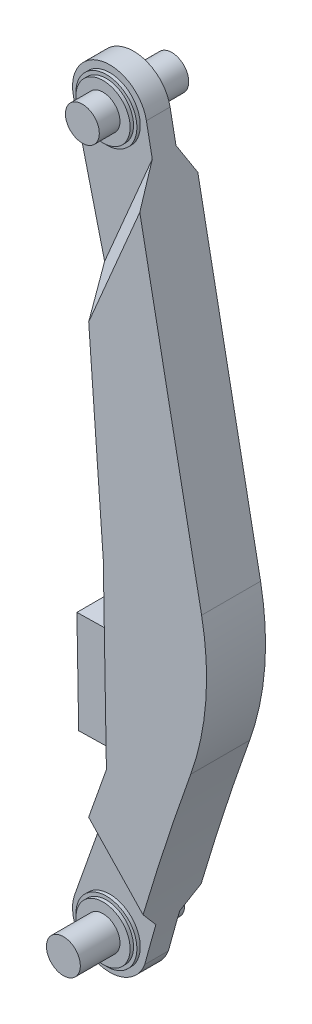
ISO-10303-21;
HEADER;
FILE_DESCRIPTION(('STEP AP214'),'2;1');
FILE_NAME('part.step','',(''),(''),'','','');
FILE_SCHEMA(('AUTOMOTIVE_DESIGN { 1 0 10303 214 1 1 1 1 }'));
ENDSEC;
DATA;
#1=APPLICATION_CONTEXT('core data for automotive mechanical design processes');
#2=APPLICATION_PROTOCOL_DEFINITION('international standard','automotive_design',2000,#1);
#3=PRODUCT_CONTEXT('',#1,'mechanical');
#4=PRODUCT('Part','Part','',(#3));
#5=PRODUCT_RELATED_PRODUCT_CATEGORY('part','',(#4));
#6=PRODUCT_DEFINITION_FORMATION('','',#4);
#7=PRODUCT_DEFINITION_CONTEXT('part definition',#1,'design');
#8=PRODUCT_DEFINITION('design','',#6,#7);
#9=PRODUCT_DEFINITION_SHAPE('','',#8);
#10=(LENGTH_UNIT() NAMED_UNIT(*) SI_UNIT(.MILLI.,.METRE.));
#11=(NAMED_UNIT(*) PLANE_ANGLE_UNIT() SI_UNIT($,.RADIAN.));
#12=(NAMED_UNIT(*) SI_UNIT($,.STERADIAN.) SOLID_ANGLE_UNIT());
#13=UNCERTAINTY_MEASURE_WITH_UNIT(LENGTH_MEASURE(1.E-05),#10,'distance_accuracy_value','');
#14=(GEOMETRIC_REPRESENTATION_CONTEXT(3) GLOBAL_UNCERTAINTY_ASSIGNED_CONTEXT((#13)) GLOBAL_UNIT_ASSIGNED_CONTEXT((#10,
#11,#12)) REPRESENTATION_CONTEXT('',''));
#15=CARTESIAN_POINT('',(0.,0.,0.));
#16=DIRECTION('',(0.,0.,1.));
#17=DIRECTION('',(1.,0.,0.));
#18=AXIS2_PLACEMENT_3D('',#15,#16,#17);
#19=CARTESIAN_POINT('',(52.8827555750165,1100.,-10.));
#20=DIRECTION('',(0.,0.,-1.));
#21=DIRECTION('',(-1.,0.,0.));
#22=AXIS2_PLACEMENT_3D('',#19,#20,#21);
#23=PLANE('',#22);
#24=CARTESIAN_POINT('',(52.8827555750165,1100.,-10.));
#25=DIRECTION('',(0.,0.,-1.));
#26=DIRECTION('',(-1.,0.,0.));
#27=AXIS2_PLACEMENT_3D('',#24,#25,#26);
#28=CIRCLE('',#27,40.);
#29=CARTESIAN_POINT('',(12.8827555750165,1100.,-10.));
#30=VERTEX_POINT('',#29);
#31=EDGE_CURVE('E164',#30,#30,#28,.T.);
#32=ORIENTED_EDGE('',*,*,#31,.T.);
#33=EDGE_LOOP('',(#32));
#34=FACE_BOUND('',#33,.T.);
#35=CARTESIAN_POINT('',(52.8827555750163,1100.,-10.));
#36=DIRECTION('',(0.,0.,-1.));
#37=DIRECTION('',(-1.,0.,0.));
#38=AXIS2_PLACEMENT_3D('',#35,#36,#37);
#39=CIRCLE('',#38,25.);
#40=CARTESIAN_POINT('',(27.8827555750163,1100.,-10.));
#41=VERTEX_POINT('',#40);
#42=EDGE_CURVE('E538',#41,#41,#39,.T.);
#43=ORIENTED_EDGE('',*,*,#42,.F.);
#44=EDGE_LOOP('',(#43));
#45=FACE_BOUND('',#44,.T.);
#46=ADVANCED_FACE('F17',(#34,#45),#23,.T.);
#47=CARTESIAN_POINT('',(52.8827555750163,1100.,45.));
#48=DIRECTION('',(0.,0.,1.));
#49=DIRECTION('',(1.,0.,0.));
#50=AXIS2_PLACEMENT_3D('',#47,#48,#49);
#51=PLANE('',#50);
#52=CARTESIAN_POINT('',(52.8827555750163,1100.,45.));
#53=DIRECTION('',(0.,0.,1.));
#54=DIRECTION('',(1.,0.,0.));
#55=AXIS2_PLACEMENT_3D('',#52,#53,#54);
#56=CIRCLE('',#55,40.);
#57=CARTESIAN_POINT('',(92.8827555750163,1100.,45.));
#58=VERTEX_POINT('',#57);
#59=EDGE_CURVE('E572',#58,#58,#56,.T.);
#60=ORIENTED_EDGE('',*,*,#59,.T.);
#61=EDGE_LOOP('',(#60));
#62=FACE_BOUND('',#61,.T.);
#63=CARTESIAN_POINT('',(52.8827555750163,1100.,45.));
#64=DIRECTION('',(0.,0.,1.));
#65=DIRECTION('',(1.,0.,0.));
#66=AXIS2_PLACEMENT_3D('',#63,#64,#65);
#67=CIRCLE('',#66,25.);
#68=CARTESIAN_POINT('',(77.8827555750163,1100.,45.));
#69=VERTEX_POINT('',#68);
#70=EDGE_CURVE('E537',#69,#69,#67,.T.);
#71=ORIENTED_EDGE('',*,*,#70,.F.);
#72=EDGE_LOOP('',(#71));
#73=FACE_BOUND('',#72,.T.);
#74=ADVANCED_FACE('F374',(#62,#73),#51,.T.);
#75=CARTESIAN_POINT('',(52.8827555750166,50.,-10.));
#76=DIRECTION('',(0.,0.,-1.));
#77=DIRECTION('',(-1.,0.,0.));
#78=AXIS2_PLACEMENT_3D('',#75,#76,#77);
#79=PLANE('',#78);
#80=CARTESIAN_POINT('',(52.8827555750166,50.,-10.));
#81=DIRECTION('',(0.,0.,-1.));
#82=DIRECTION('',(-1.,0.,0.));
#83=AXIS2_PLACEMENT_3D('',#80,#81,#82);
#84=CIRCLE('',#83,40.);
#85=CARTESIAN_POINT('',(12.8827555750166,50.,-10.));
#86=VERTEX_POINT('',#85);
#87=EDGE_CURVE('E566',#86,#86,#84,.T.);
#88=ORIENTED_EDGE('',*,*,#87,.T.);
#89=EDGE_LOOP('',(#88));
#90=FACE_BOUND('',#89,.T.);
#91=CARTESIAN_POINT('',(52.8827555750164,50.,-10.));
#92=DIRECTION('',(0.,0.,-1.));
#93=DIRECTION('',(-1.,0.,0.));
#94=AXIS2_PLACEMENT_3D('',#91,#92,#93);
#95=CIRCLE('',#94,25.);
#96=CARTESIAN_POINT('',(27.8827555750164,50.,-10.));
#97=VERTEX_POINT('',#96);
#98=EDGE_CURVE('E547',#97,#97,#95,.T.);
#99=ORIENTED_EDGE('',*,*,#98,.F.);
#100=EDGE_LOOP('',(#99));
#101=FACE_BOUND('',#100,.T.);
#102=ADVANCED_FACE('F380',(#90,#101),#79,.T.);
#103=CARTESIAN_POINT('',(52.8827555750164,50.,45.));
#104=DIRECTION('',(0.,0.,1.));
#105=DIRECTION('',(1.,0.,0.));
#106=AXIS2_PLACEMENT_3D('',#103,#104,#105);
#107=PLANE('',#106);
#108=CARTESIAN_POINT('',(52.8827555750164,50.,45.));
#109=DIRECTION('',(0.,0.,1.));
#110=DIRECTION('',(1.,0.,0.));
#111=AXIS2_PLACEMENT_3D('',#108,#109,#110);
#112=CIRCLE('',#111,40.);
#113=CARTESIAN_POINT('',(92.8827555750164,50.,45.));
#114=VERTEX_POINT('',#113);
#115=EDGE_CURVE('E563',#114,#114,#112,.T.);
#116=ORIENTED_EDGE('',*,*,#115,.T.);
#117=EDGE_LOOP('',(#116));
#118=FACE_BOUND('',#117,.T.);
#119=CARTESIAN_POINT('',(52.8827555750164,50.,45.));
#120=DIRECTION('',(0.,0.,1.));
#121=DIRECTION('',(1.,0.,0.));
#122=AXIS2_PLACEMENT_3D('',#119,#120,#121);
#123=CIRCLE('',#122,25.);
#124=CARTESIAN_POINT('',(77.8827555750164,50.,45.));
#125=VERTEX_POINT('',#124);
#126=EDGE_CURVE('E552',#125,#125,#123,.T.);
#127=ORIENTED_EDGE('',*,*,#126,.F.);
#128=EDGE_LOOP('',(#127));
#129=FACE_BOUND('',#128,.T.);
#130=ADVANCED_FACE('F461',(#118,#129),#107,.T.);
#131=CARTESIAN_POINT('',(52.8827555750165,50.,40.));
#132=DIRECTION('',(0.,0.,1.));
#133=DIRECTION('',(1.,0.,0.));
#134=AXIS2_PLACEMENT_3D('',#131,#132,#133);
#135=PLANE('',#134);
#136=CARTESIAN_POINT('',(52.8827555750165,50.,40.));
#137=DIRECTION('',(0.,0.,1.));
#138=DIRECTION('',(1.,0.,0.));
#139=AXIS2_PLACEMENT_3D('',#136,#137,#138);
#140=CIRCLE('',#139,45.);
#141=CARTESIAN_POINT('',(97.8827555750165,50.,40.));
#142=VERTEX_POINT('',#141);
#143=EDGE_CURVE('E249',#142,#142,#140,.T.);
#144=ORIENTED_EDGE('',*,*,#143,.T.);
#145=EDGE_LOOP('',(#144));
#146=FACE_BOUND('',#145,.T.);
#147=CARTESIAN_POINT('',(52.8827555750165,50.,40.));
#148=DIRECTION('',(0.,0.,1.));
#149=DIRECTION('',(1.,0.,0.));
#150=AXIS2_PLACEMENT_3D('',#147,#148,#149);
#151=CIRCLE('',#150,40.);
#152=CARTESIAN_POINT('',(92.8827555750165,50.,40.));
#153=VERTEX_POINT('',#152);
#154=EDGE_CURVE('E558',#153,#153,#151,.T.);
#155=ORIENTED_EDGE('',*,*,#154,.F.);
#156=EDGE_LOOP('',(#155));
#157=FACE_BOUND('',#156,.T.);
#158=ADVANCED_FACE('F458',(#146,#157),#135,.T.);
#159=CARTESIAN_POINT('',(52.8827555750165,50.,-5.));
#160=DIRECTION('',(0.,0.,1.));
#161=DIRECTION('',(1.,0.,0.));
#162=AXIS2_PLACEMENT_3D('',#159,#160,#161);
#163=PLANE('',#162);
#164=CARTESIAN_POINT('',(52.8827555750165,50.,-5.));
#165=DIRECTION('',(0.,0.,1.));
#166=DIRECTION('',(1.,0.,0.));
#167=AXIS2_PLACEMENT_3D('',#164,#165,#166);
#168=CIRCLE('',#167,45.);
#169=CARTESIAN_POINT('',(97.8827555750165,50.,-5.));
#170=VERTEX_POINT('',#169);
#171=EDGE_CURVE('E246',#170,#170,#168,.T.);
#172=ORIENTED_EDGE('',*,*,#171,.F.);
#173=EDGE_LOOP('',(#172));
#174=FACE_BOUND('',#173,.T.);
#175=CARTESIAN_POINT('',(52.8827555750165,50.,-5.));
#176=DIRECTION('',(0.,0.,1.));
#177=DIRECTION('',(1.,0.,0.));
#178=AXIS2_PLACEMENT_3D('',#175,#176,#177);
#179=CIRCLE('',#178,40.);
#180=CARTESIAN_POINT('',(92.8827555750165,50.,-5.));
#181=VERTEX_POINT('',#180);
#182=EDGE_CURVE('E11',#181,#181,#179,.F.);
#183=ORIENTED_EDGE('',*,*,#182,.F.);
#184=EDGE_LOOP('',(#183));
#185=FACE_BOUND('',#184,.T.);
#186=ADVANCED_FACE('F368',(#174,#185),#163,.F.);
#187=CARTESIAN_POINT('',(52.8827555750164,1100.,40.));
#188=DIRECTION('',(0.,0.,1.));
#189=DIRECTION('',(1.,0.,0.));
#190=AXIS2_PLACEMENT_3D('',#187,#188,#189);
#191=PLANE('',#190);
#192=CARTESIAN_POINT('',(52.8827555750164,1100.,40.));
#193=DIRECTION('',(0.,0.,1.));
#194=DIRECTION('',(1.,0.,0.));
#195=AXIS2_PLACEMENT_3D('',#192,#193,#194);
#196=CIRCLE('',#195,45.);
#197=CARTESIAN_POINT('',(97.8827555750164,1100.,40.));
#198=VERTEX_POINT('',#197);
#199=EDGE_CURVE('E261',#198,#198,#196,.T.);
#200=ORIENTED_EDGE('',*,*,#199,.T.);
#201=EDGE_LOOP('',(#200));
#202=FACE_BOUND('',#201,.T.);
#203=CARTESIAN_POINT('',(52.8827555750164,1100.,40.));
#204=DIRECTION('',(0.,0.,1.));
#205=DIRECTION('',(1.,0.,0.));
#206=AXIS2_PLACEMENT_3D('',#203,#204,#205);
#207=CIRCLE('',#206,40.);
#208=CARTESIAN_POINT('',(92.8827555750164,1100.,40.));
#209=VERTEX_POINT('',#208);
#210=EDGE_CURVE('E569',#209,#209,#207,.T.);
#211=ORIENTED_EDGE('',*,*,#210,.F.);
#212=EDGE_LOOP('',(#211));
#213=FACE_BOUND('',#212,.T.);
#214=ADVANCED_FACE('F357',(#202,#213),#191,.T.);
#215=CARTESIAN_POINT('',(52.8827555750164,1100.,-5.));
#216=DIRECTION('',(0.,0.,1.));
#217=DIRECTION('',(1.,0.,0.));
#218=AXIS2_PLACEMENT_3D('',#215,#216,#217);
#219=PLANE('',#218);
#220=CARTESIAN_POINT('',(52.8827555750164,1100.,-5.));
#221=DIRECTION('',(0.,0.,1.));
#222=DIRECTION('',(1.,0.,0.));
#223=AXIS2_PLACEMENT_3D('',#220,#221,#222);
#224=CIRCLE('',#223,45.);
#225=CARTESIAN_POINT('',(97.8827555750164,1100.,-5.));
#226=VERTEX_POINT('',#225);
#227=EDGE_CURVE('E258',#226,#226,#224,.T.);
#228=ORIENTED_EDGE('',*,*,#227,.F.);
#229=EDGE_LOOP('',(#228));
#230=FACE_BOUND('',#229,.T.);
#231=CARTESIAN_POINT('',(52.8827555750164,1100.,-5.));
#232=DIRECTION('',(0.,0.,1.));
#233=DIRECTION('',(1.,0.,0.));
#234=AXIS2_PLACEMENT_3D('',#231,#232,#233);
#235=CIRCLE('',#234,40.);
#236=CARTESIAN_POINT('',(92.8827555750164,1100.,-5.));
#237=VERTEX_POINT('',#236);
#238=EDGE_CURVE('E26',#237,#237,#235,.F.);
#239=ORIENTED_EDGE('',*,*,#238,.F.);
#240=EDGE_LOOP('',(#239));
#241=FACE_BOUND('',#240,.T.);
#242=ADVANCED_FACE('F355',(#230,#241),#219,.F.);
#243=CARTESIAN_POINT('',(71.231981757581,546.158587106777,35.));
#244=DIRECTION('',(0.999847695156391,0.0174524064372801,0.));
#245=DIRECTION('',(-0.0174524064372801,0.999847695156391,0.));
#246=AXIS2_PLACEMENT_3D('',#243,#244,#245);
#247=PLANE('',#246);
#248=DIRECTION('',(0.,0.,-1.));
#249=VECTOR('',#248,1.);
#250=CARTESIAN_POINT('',(71.231981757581,546.158587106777,35.));
#251=LINE('',#250,#249);
#252=CARTESIAN_POINT('',(71.2319817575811,546.158587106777,63.));
#253=VERTEX_POINT('',#252);
#254=CARTESIAN_POINT('',(71.2319817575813,546.158587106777,-24.));
#255=VERTEX_POINT('',#254);
#256=EDGE_CURVE('E309',#253,#255,#251,.T.);
#257=ORIENTED_EDGE('',*,*,#256,.T.);
#258=DIRECTION('',(0.0174524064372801,-0.999847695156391,0.));
#259=VECTOR('',#258,1.);
#260=CARTESIAN_POINT('',(71.2319817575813,546.158587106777,-24.));
#261=LINE('',#260,#259);
#262=CARTESIAN_POINT('',(75.8827555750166,279.715933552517,-24.));
#263=VERTEX_POINT('',#262);
#264=EDGE_CURVE('E227',#255,#263,#261,.T.);
#265=ORIENTED_EDGE('',*,*,#264,.T.);
#266=DIRECTION('',(0.,0.,-1.));
#267=VECTOR('',#266,1.);
#268=CARTESIAN_POINT('',(75.8827555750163,279.715933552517,35.));
#269=LINE('',#268,#267);
#270=CARTESIAN_POINT('',(75.8827555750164,279.715933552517,63.));
#271=VERTEX_POINT('',#270);
#272=EDGE_CURVE('E307',#271,#263,#269,.T.);
#273=ORIENTED_EDGE('',*,*,#272,.F.);
#274=DIRECTION('',(0.0174524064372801,-0.999847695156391,0.));
#275=VECTOR('',#274,1.);
#276=CARTESIAN_POINT('',(71.2319817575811,546.158587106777,63.));
#277=LINE('',#276,#275);
#278=EDGE_CURVE('E211',#253,#271,#277,.T.);
#279=ORIENTED_EDGE('',*,*,#278,.F.);
#280=EDGE_LOOP('',(#257,#265,#273,#279));
#281=FACE_BOUND('',#280,.T.);
#282=DIRECTION('',(-0.0174524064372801,0.999847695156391,0.));
#283=VECTOR('',#282,1.);
#284=CARTESIAN_POINT('',(72.8204454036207,455.155565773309,58.5));
#285=LINE('',#284,#283);
#286=CARTESIAN_POINT('',(75.4383063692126,305.17841149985,58.5));
#287=VERTEX_POINT('',#286);
#288=CARTESIAN_POINT('',(72.8204454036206,455.155565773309,58.5));
#289=VERTEX_POINT('',#288);
#290=EDGE_CURVE('E157',#287,#289,#285,.T.);
#291=ORIENTED_EDGE('',*,*,#290,.F.);
#292=DIRECTION('',(0.,0.,1.));
#293=VECTOR('',#292,1.);
#294=CARTESIAN_POINT('',(75.4383063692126,305.17841149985,58.5));
#295=LINE('',#294,#293);
#296=CARTESIAN_POINT('',(75.4383063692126,305.17841149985,8.50000000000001));
#297=VERTEX_POINT('',#296);
#298=EDGE_CURVE('E160',#297,#287,#295,.T.);
#299=ORIENTED_EDGE('',*,*,#298,.F.);
#300=DIRECTION('',(0.0174524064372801,-0.999847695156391,0.));
#301=VECTOR('',#300,1.);
#302=CARTESIAN_POINT('',(72.8204454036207,455.155565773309,8.50000000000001));
#303=LINE('',#302,#301);
#304=CARTESIAN_POINT('',(72.8204454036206,455.155565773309,8.50000000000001));
#305=VERTEX_POINT('',#304);
#306=EDGE_CURVE('E38',#305,#297,#303,.T.);
#307=ORIENTED_EDGE('',*,*,#306,.F.);
#308=DIRECTION('',(0.,0.,-1.));
#309=VECTOR('',#308,1.);
#310=CARTESIAN_POINT('',(72.8204454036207,455.155565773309,58.5));
#311=LINE('',#310,#309);
#312=EDGE_CURVE('E33',#289,#305,#311,.T.);
#313=ORIENTED_EDGE('',*,*,#312,.F.);
#314=EDGE_LOOP('',(#291,#299,#307,#313));
#315=FACE_BOUND('',#314,.T.);
#316=ADVANCED_FACE('F159',(#281,#315),#247,.F.);
#317=CARTESIAN_POINT('',(52.8827555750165,1100.,35.));
#318=DIRECTION('',(0.,0.,-1.));
#319=DIRECTION('',(-1.,0.,0.));
#320=AXIS2_PLACEMENT_3D('',#317,#318,#319);
#321=PLANE('',#320);
#322=CARTESIAN_POINT('',(52.8827555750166,50.,35.));
#323=DIRECTION('',(0.,0.,-1.));
#324=DIRECTION('',(-1.,0.,0.));
#325=AXIS2_PLACEMENT_3D('',#322,#323,#324);
#326=CIRCLE('',#325,45.);
#327=CARTESIAN_POINT('',(7.8827555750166,50.,35.));
#328=VERTEX_POINT('',#327);
#329=EDGE_CURVE('E253',#328,#328,#326,.F.);
#330=ORIENTED_EDGE('',*,*,#329,.F.);
#331=EDGE_LOOP('',(#330));
#332=FACE_BOUND('',#331,.T.);
#333=CARTESIAN_POINT('',(3965.40296443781,-1014.56231606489,35.));
#334=DIRECTION('',(0.,0.,-1.));
#335=DIRECTION('',(-1.,0.,0.));
#336=AXIS2_PLACEMENT_3D('',#333,#334,#335);
#337=CIRCLE('',#336,4000.);
#338=CARTESIAN_POINT('',(104.399725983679,30.738594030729,35.));
#339=VERTEX_POINT('',#338);
#340=CARTESIAN_POINT('',(120.933938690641,90.0000000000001,35.));
#341=VERTEX_POINT('',#340);
#342=EDGE_CURVE('E293',#339,#341,#337,.T.);
#343=ORIENTED_EDGE('',*,*,#342,.T.);
#344=DIRECTION('',(-0.688952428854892,0.724806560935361,0.));
#345=VECTOR('',#344,1.);
#346=CARTESIAN_POINT('',(-415.717739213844,654.579847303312,35.));
#347=LINE('',#346,#345);
#348=CARTESIAN_POINT('',(39.1640010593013,176.025369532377,35.));
#349=VERTEX_POINT('',#348);
#350=EDGE_CURVE('E244',#341,#349,#347,.T.);
#351=ORIENTED_EDGE('',*,*,#350,.T.);
#352=DIRECTION('',(-0.333806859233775,-0.942641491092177,0.));
#353=VECTOR('',#352,1.);
#354=CARTESIAN_POINT('',(75.8827555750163,279.715933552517,35.));
#355=LINE('',#354,#353);
#356=CARTESIAN_POINT('',(1.03747356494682,68.3593772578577,35.));
#357=VERTEX_POINT('',#356);
#358=EDGE_CURVE('E289',#349,#357,#355,.T.);
#359=ORIENTED_EDGE('',*,*,#358,.T.);
#360=CARTESIAN_POINT('',(52.8827555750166,50.,35.));
#361=DIRECTION('',(0.,0.,1.));
#362=DIRECTION('',(1.,0.,0.));
#363=AXIS2_PLACEMENT_3D('',#360,#361,#362);
#364=CIRCLE('',#363,55.);
#365=EDGE_CURVE('E291',#357,#339,#364,.T.);
#366=ORIENTED_EDGE('',*,*,#365,.T.);
#367=EDGE_LOOP('',(#343,#351,#359,#366));
#368=FACE_BOUND('',#367,.T.);
#369=ADVANCED_FACE('F365',(#332,#368),#321,.F.);
#370=CARTESIAN_POINT('',(52.8827555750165,1100.,0.));
#371=DIRECTION('',(0.,0.,-1.));
#372=DIRECTION('',(-1.,0.,0.));
#373=AXIS2_PLACEMENT_3D('',#370,#371,#372);
#374=PLANE('',#373);
#375=DIRECTION('',(-0.688952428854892,0.724806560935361,0.));
#376=VECTOR('',#375,1.);
#377=CARTESIAN_POINT('',(-415.717739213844,654.579847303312,0.));
#378=LINE('',#377,#376);
#379=CARTESIAN_POINT('',(120.933938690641,90.0000000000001,0.));
#380=VERTEX_POINT('',#379);
#381=CARTESIAN_POINT('',(39.1640010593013,176.025369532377,0.));
#382=VERTEX_POINT('',#381);
#383=EDGE_CURVE('E241',#380,#382,#378,.T.);
#384=ORIENTED_EDGE('',*,*,#383,.F.);
#385=CARTESIAN_POINT('',(3965.40296443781,-1014.56231606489,0.));
#386=DIRECTION('',(0.,0.,-1.));
#387=DIRECTION('',(-1.,0.,0.));
#388=AXIS2_PLACEMENT_3D('',#385,#386,#387);
#389=CIRCLE('',#388,4000.);
#390=CARTESIAN_POINT('',(104.399725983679,30.738594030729,0.));
#391=VERTEX_POINT('',#390);
#392=EDGE_CURVE('E278',#391,#380,#389,.T.);
#393=ORIENTED_EDGE('',*,*,#392,.F.);
#394=CARTESIAN_POINT('',(52.8827555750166,50.,0.));
#395=DIRECTION('',(0.,0.,1.));
#396=DIRECTION('',(1.,0.,0.));
#397=AXIS2_PLACEMENT_3D('',#394,#395,#396);
#398=CIRCLE('',#397,55.);
#399=CARTESIAN_POINT('',(1.03747356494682,68.3593772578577,0.));
#400=VERTEX_POINT('',#399);
#401=EDGE_CURVE('E276',#400,#391,#398,.T.);
#402=ORIENTED_EDGE('',*,*,#401,.F.);
#403=DIRECTION('',(-0.333806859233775,-0.942641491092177,0.));
#404=VECTOR('',#403,1.);
#405=CARTESIAN_POINT('',(75.8827555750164,279.715933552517,0.));
#406=LINE('',#405,#404);
#407=EDGE_CURVE('E274',#382,#400,#406,.T.);
#408=ORIENTED_EDGE('',*,*,#407,.F.);
#409=EDGE_LOOP('',(#384,#393,#402,#408));
#410=FACE_BOUND('',#409,.T.);
#411=CARTESIAN_POINT('',(52.8827555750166,50.,0.));
#412=DIRECTION('',(0.,0.,-1.));
#413=DIRECTION('',(-1.,0.,0.));
#414=AXIS2_PLACEMENT_3D('',#411,#412,#413);
#415=CIRCLE('',#414,45.);
#416=CARTESIAN_POINT('',(7.8827555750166,50.,0.));
#417=VERTEX_POINT('',#416);
#418=EDGE_CURVE('E252',#417,#417,#415,.F.);
#419=ORIENTED_EDGE('',*,*,#418,.T.);
#420=EDGE_LOOP('',(#419));
#421=FACE_BOUND('',#420,.T.);
#422=ADVANCED_FACE('F681',(#410,#421),#374,.T.);
#423=CARTESIAN_POINT('',(52.8827555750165,1100.,35.));
#424=DIRECTION('',(0.,0.,-1.));
#425=DIRECTION('',(-1.,0.,0.));
#426=AXIS2_PLACEMENT_3D('',#423,#424,#425);
#427=CIRCLE('',#426,45.);
#428=CARTESIAN_POINT('',(7.88275557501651,1100.,35.));
#429=VERTEX_POINT('',#428);
#430=EDGE_CURVE('E257',#429,#429,#427,.F.);
#431=ORIENTED_EDGE('',*,*,#430,.F.);
#432=EDGE_LOOP('',(#431));
#433=FACE_BOUND('',#432,.T.);
#434=DIRECTION('',(0.23791992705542,-0.971284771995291,0.));
#435=VECTOR('',#434,1.);
#436=CARTESIAN_POINT('',(-0.537906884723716,1086.91440401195,35.));
#437=LINE('',#436,#435);
#438=CARTESIAN_POINT('',(-0.537906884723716,1086.91440401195,35.));
#439=VERTEX_POINT('',#438);
#440=CARTESIAN_POINT('',(45.2474926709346,900.,35.));
#441=VERTEX_POINT('',#440);
#442=EDGE_CURVE('E286',#439,#441,#437,.T.);
#443=ORIENTED_EDGE('',*,*,#442,.T.);
#444=DIRECTION('',(0.390731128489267,0.920504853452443,0.));
#445=VECTOR('',#444,1.);
#446=CARTESIAN_POINT('',(118.347154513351,1072.21201129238,35.));
#447=LINE('',#446,#445);
#448=CARTESIAN_POINT('',(115.580533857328,1065.69426147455,35.));
#449=VERTEX_POINT('',#448);
#450=EDGE_CURVE('E238',#441,#449,#447,.T.);
#451=ORIENTED_EDGE('',*,*,#450,.T.);
#452=DIRECTION('',(-0.190808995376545,0.981627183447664,0.));
#453=VECTOR('',#452,1.);
#454=CARTESIAN_POINT('',(106.872250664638,1110.49449474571,35.));
#455=LINE('',#454,#453);
#456=CARTESIAN_POINT('',(106.872250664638,1110.49449474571,35.));
#457=VERTEX_POINT('',#456);
#458=EDGE_CURVE('E296',#449,#457,#455,.T.);
#459=ORIENTED_EDGE('',*,*,#458,.T.);
#460=CARTESIAN_POINT('',(52.8827555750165,1100.,35.));
#461=DIRECTION('',(0.,0.,1.));
#462=DIRECTION('',(-1.,0.,0.));
#463=AXIS2_PLACEMENT_3D('',#460,#461,#462);
#464=CIRCLE('',#463,55.);
#465=EDGE_CURVE('E283',#457,#439,#464,.T.);
#466=ORIENTED_EDGE('',*,*,#465,.T.);
#467=EDGE_LOOP('',(#443,#451,#459,#466));
#468=FACE_BOUND('',#467,.T.);
#469=ADVANCED_FACE('F683',(#433,#468),#321,.F.);
#470=DIRECTION('',(0.390731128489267,0.920504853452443,0.));
#471=VECTOR('',#470,1.);
#472=CARTESIAN_POINT('',(118.347154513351,1072.21201129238,0.));
#473=LINE('',#472,#471);
#474=CARTESIAN_POINT('',(45.2474926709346,900.,0.));
#475=VERTEX_POINT('',#474);
#476=CARTESIAN_POINT('',(115.580533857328,1065.69426147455,0.));
#477=VERTEX_POINT('',#476);
#478=EDGE_CURVE('E235',#475,#477,#473,.T.);
#479=ORIENTED_EDGE('',*,*,#478,.F.);
#480=DIRECTION('',(0.23791992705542,-0.971284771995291,0.));
#481=VECTOR('',#480,1.);
#482=CARTESIAN_POINT('',(-0.537906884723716,1086.91440401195,0.));
#483=LINE('',#482,#481);
#484=CARTESIAN_POINT('',(-0.537906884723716,1086.91440401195,0.));
#485=VERTEX_POINT('',#484);
#486=EDGE_CURVE('E271',#485,#475,#483,.T.);
#487=ORIENTED_EDGE('',*,*,#486,.F.);
#488=CARTESIAN_POINT('',(52.8827555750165,1100.,0.));
#489=DIRECTION('',(0.,0.,1.));
#490=DIRECTION('',(-1.,0.,0.));
#491=AXIS2_PLACEMENT_3D('',#488,#489,#490);
#492=CIRCLE('',#491,55.);
#493=CARTESIAN_POINT('',(106.872250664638,1110.49449474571,0.));
#494=VERTEX_POINT('',#493);
#495=EDGE_CURVE('E268',#494,#485,#492,.T.);
#496=ORIENTED_EDGE('',*,*,#495,.F.);
#497=DIRECTION('',(-0.190808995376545,0.981627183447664,0.));
#498=VECTOR('',#497,1.);
#499=CARTESIAN_POINT('',(106.872250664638,1110.49449474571,0.));
#500=LINE('',#499,#498);
#501=EDGE_CURVE('E281',#477,#494,#500,.T.);
#502=ORIENTED_EDGE('',*,*,#501,.F.);
#503=EDGE_LOOP('',(#479,#487,#496,#502));
#504=FACE_BOUND('',#503,.T.);
#505=CARTESIAN_POINT('',(52.8827555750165,1100.,0.));
#506=DIRECTION('',(0.,0.,-1.));
#507=DIRECTION('',(-1.,0.,0.));
#508=AXIS2_PLACEMENT_3D('',#505,#506,#507);
#509=CIRCLE('',#508,45.);
#510=CARTESIAN_POINT('',(7.88275557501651,1100.,0.));
#511=VERTEX_POINT('',#510);
#512=EDGE_CURVE('E264',#511,#511,#509,.F.);
#513=ORIENTED_EDGE('',*,*,#512,.T.);
#514=EDGE_LOOP('',(#513));
#515=FACE_BOUND('',#514,.T.);
#516=ADVANCED_FACE('F686',(#504,#515),#374,.T.);
#517=CARTESIAN_POINT('',(52.8827555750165,1100.,35.));
#518=DIRECTION('',(0.,0.,-1.));
#519=DIRECTION('',(-1.,0.,0.));
#520=AXIS2_PLACEMENT_3D('',#517,#518,#519);
#521=CYLINDRICAL_SURFACE('',#520,55.);
#522=ORIENTED_EDGE('',*,*,#495,.T.);
#523=DIRECTION('',(0.,0.,-1.));
#524=VECTOR('',#523,1.);
#525=CARTESIAN_POINT('',(-0.537906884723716,1086.91440401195,35.));
#526=LINE('',#525,#524);
#527=EDGE_CURVE('E315',#439,#485,#526,.T.);
#528=ORIENTED_EDGE('',*,*,#527,.F.);
#529=ORIENTED_EDGE('',*,*,#465,.F.);
#530=DIRECTION('',(0.,0.,-1.));
#531=VECTOR('',#530,1.);
#532=CARTESIAN_POINT('',(106.872250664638,1110.49449474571,35.));
#533=LINE('',#532,#531);
#534=EDGE_CURVE('E298',#457,#494,#533,.T.);
#535=ORIENTED_EDGE('',*,*,#534,.T.);
#536=EDGE_LOOP('',(#522,#528,#529,#535));
#537=FACE_BOUND('',#536,.T.);
#538=ADVANCED_FACE('F19',(#537),#521,.T.);
#539=CARTESIAN_POINT('',(-0.537906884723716,1086.91440401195,35.));
#540=DIRECTION('',(0.971284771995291,0.23791992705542,0.));
#541=DIRECTION('',(-0.23791992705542,0.971284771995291,0.));
#542=AXIS2_PLACEMENT_3D('',#539,#540,#541);
#543=PLANE('',#542);
#544=ORIENTED_EDGE('',*,*,#486,.T.);
#545=DIRECTION('',(0.,0.,-1.));
#546=VECTOR('',#545,1.);
#547=CARTESIAN_POINT('',(45.2474926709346,900.,35.));
#548=LINE('',#547,#546);
#549=EDGE_CURVE('E312',#441,#475,#548,.T.);
#550=ORIENTED_EDGE('',*,*,#549,.F.);
#551=ORIENTED_EDGE('',*,*,#442,.F.);
#552=ORIENTED_EDGE('',*,*,#527,.T.);
#553=EDGE_LOOP('',(#544,#550,#551,#552));
#554=FACE_BOUND('',#553,.T.);
#555=ADVANCED_FACE('F701',(#554),#543,.F.);
#556=CARTESIAN_POINT('',(45.2474926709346,900.,35.));
#557=DIRECTION('',(0.997314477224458,0.0732381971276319,0.));
#558=DIRECTION('',(-0.0732381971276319,0.997314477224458,0.));
#559=AXIS2_PLACEMENT_3D('',#556,#557,#558);
#560=PLANE('',#559);
#561=DIRECTION('',(0.0732381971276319,-0.997314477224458,0.));
#562=VECTOR('',#561,1.);
#563=CARTESIAN_POINT('',(45.2474926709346,900.,63.));
#564=LINE('',#563,#562);
#565=CARTESIAN_POINT('',(49.7337731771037,838.908483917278,63.));
#566=VERTEX_POINT('',#565);
#567=EDGE_CURVE('E209',#566,#253,#564,.T.);
#568=ORIENTED_EDGE('',*,*,#567,.F.);
#569=DIRECTION('',(0.0666094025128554,-0.907047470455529,0.415725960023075));
#570=VECTOR('',#569,1.);
#571=CARTESIAN_POINT('',(72.7469435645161,525.5287327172,206.630958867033));
#572=LINE('',#571,#570);
#573=EDGE_CURVE('E343',#566,#441,#572,.F.);
#574=ORIENTED_EDGE('',*,*,#573,.T.);
#575=ORIENTED_EDGE('',*,*,#549,.T.);
#576=DIRECTION('',(0.0666094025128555,-0.90704747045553,-0.415725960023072));
#577=VECTOR('',#576,1.);
#578=CARTESIAN_POINT('',(35.5486495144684,1032.0731130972,60.5329087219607));
#579=LINE('',#578,#577);
#580=CARTESIAN_POINT('',(49.0928759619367,847.635843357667,-24.));
#581=VERTEX_POINT('',#580);
#582=EDGE_CURVE('E333',#475,#581,#579,.T.);
#583=ORIENTED_EDGE('',*,*,#582,.T.);
#584=DIRECTION('',(0.0732381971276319,-0.997314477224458,0.));
#585=VECTOR('',#584,1.);
#586=CARTESIAN_POINT('',(45.2474926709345,900.,-24.));
#587=LINE('',#586,#585);
#588=EDGE_CURVE('E225',#581,#255,#587,.T.);
#589=ORIENTED_EDGE('',*,*,#588,.T.);
#590=ORIENTED_EDGE('',*,*,#256,.F.);
#591=EDGE_LOOP('',(#568,#574,#575,#583,#589,#590));
#592=FACE_BOUND('',#591,.T.);
#593=ADVANCED_FACE('F739',(#592),#560,.F.);
#594=CARTESIAN_POINT('',(75.8827555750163,279.715933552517,35.));
#595=DIRECTION('',(0.942641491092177,-0.333806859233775,0.));
#596=DIRECTION('',(0.333806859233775,0.942641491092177,0.));
#597=AXIS2_PLACEMENT_3D('',#594,#595,#596);
#598=PLANE('',#597);
#599=ORIENTED_EDGE('',*,*,#358,.F.);
#600=DIRECTION('',(-0.249181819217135,-0.703667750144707,-0.665402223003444));
#601=VECTOR('',#600,1.);
#602=CARTESIAN_POINT('',(78.9799095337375,288.462026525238,141.322339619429));
#603=LINE('',#602,#601);
#604=CARTESIAN_POINT('',(49.6495249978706,205.635575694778,63.));
#605=VERTEX_POINT('',#604);
#606=EDGE_CURVE('E349',#349,#605,#603,.F.);
#607=ORIENTED_EDGE('',*,*,#606,.T.);
#608=DIRECTION('',(-0.333806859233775,-0.942641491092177,0.));
#609=VECTOR('',#608,1.);
#610=CARTESIAN_POINT('',(75.8827555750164,279.715933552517,63.));
#611=LINE('',#610,#609);
#612=EDGE_CURVE('E214',#271,#605,#611,.T.);
#613=ORIENTED_EDGE('',*,*,#612,.F.);
#614=ORIENTED_EDGE('',*,*,#272,.T.);
#615=DIRECTION('',(-0.333806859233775,-0.942641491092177,0.));
#616=VECTOR('',#615,1.);
#617=CARTESIAN_POINT('',(75.8827555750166,279.715933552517,-24.));
#618=LINE('',#617,#616);
#619=CARTESIAN_POINT('',(48.1515930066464,201.405546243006,-24.));
#620=VERTEX_POINT('',#619);
#621=EDGE_CURVE('E230',#263,#620,#618,.T.);
#622=ORIENTED_EDGE('',*,*,#621,.T.);
#623=DIRECTION('',(-0.249181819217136,-0.703667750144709,0.665402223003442));
#624=VECTOR('',#623,1.);
#625=CARTESIAN_POINT('',(29.157433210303,147.767693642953,26.7210204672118));
#626=LINE('',#625,#624);
#627=EDGE_CURVE('E331',#620,#382,#626,.T.);
#628=ORIENTED_EDGE('',*,*,#627,.T.);
#629=ORIENTED_EDGE('',*,*,#407,.T.);
#630=DIRECTION('',(0.,0.,-1.));
#631=VECTOR('',#630,1.);
#632=CARTESIAN_POINT('',(1.03747356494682,68.3593772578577,35.));
#633=LINE('',#632,#631);
#634=EDGE_CURVE('E304',#357,#400,#633,.T.);
#635=ORIENTED_EDGE('',*,*,#634,.F.);
#636=EDGE_LOOP('',(#599,#607,#613,#614,#622,#628,#629,#635));
#637=FACE_BOUND('',#636,.T.);
#638=ADVANCED_FACE('F757',(#637),#598,.F.);
#639=CARTESIAN_POINT('',(52.8827555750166,50.,35.));
#640=DIRECTION('',(0.,0.,-1.));
#641=DIRECTION('',(-1.,0.,0.));
#642=AXIS2_PLACEMENT_3D('',#639,#640,#641);
#643=CYLINDRICAL_SURFACE('',#642,55.);
#644=ORIENTED_EDGE('',*,*,#401,.T.);
#645=DIRECTION('',(0.,0.,-1.));
#646=VECTOR('',#645,1.);
#647=CARTESIAN_POINT('',(104.399725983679,30.738594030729,35.));
#648=LINE('',#647,#646);
#649=EDGE_CURVE('E301',#339,#391,#648,.T.);
#650=ORIENTED_EDGE('',*,*,#649,.F.);
#651=ORIENTED_EDGE('',*,*,#365,.F.);
#652=ORIENTED_EDGE('',*,*,#634,.T.);
#653=EDGE_LOOP('',(#644,#650,#651,#652));
#654=FACE_BOUND('',#653,.T.);
#655=ADVANCED_FACE('F762',(#654),#643,.T.);
#656=CARTESIAN_POINT('',(3965.40296443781,-1014.56231606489,35.));
#657=DIRECTION('',(0.,0.,-1.));
#658=DIRECTION('',(-1.,0.,0.));
#659=AXIS2_PLACEMENT_3D('',#656,#657,#658);
#660=CYLINDRICAL_SURFACE('',#659,4000.);
#661=CARTESIAN_POINT('',(3965.40296443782,-1014.56231606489,63.));
#662=DIRECTION('',(0.,0.,-1.));
#663=DIRECTION('',(1.,0.,0.));
#664=AXIS2_PLACEMENT_3D('',#661,#662,#663);
#665=CIRCLE('',#664,4000.);
#666=CARTESIAN_POINT('',(130.005251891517,121.098014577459,63.));
#667=VERTEX_POINT('',#666);
#668=CARTESIAN_POINT('',(200.236073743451,335.814773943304,63.));
#669=VERTEX_POINT('',#668);
#670=EDGE_CURVE('E217',#667,#669,#665,.T.);
#671=ORIENTED_EDGE('',*,*,#670,.F.);
#672=CARTESIAN_POINT('',(3965.40296443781,-1014.56231606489,2060.50548269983));
#673=DIRECTION('',(0.512515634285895,0.487162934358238,-0.707106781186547));
#674=DIRECTION('',(-0.512515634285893,-0.487162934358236,-0.707106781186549));
#675=AXIS2_PLACEMENT_3D('',#672,#673,#674);
#676=ELLIPSE('',#675,5656.85424949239,4000.);
#677=EDGE_CURVE('E347',#667,#341,#676,.F.);
#678=ORIENTED_EDGE('',*,*,#677,.T.);
#679=ORIENTED_EDGE('',*,*,#342,.F.);
#680=ORIENTED_EDGE('',*,*,#649,.T.);
#681=ORIENTED_EDGE('',*,*,#392,.T.);
#682=CARTESIAN_POINT('',(3965.40296443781,-1014.56231606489,-2025.50548269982));
#683=DIRECTION('',(-0.512515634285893,-0.487162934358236,-0.707106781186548));
#684=DIRECTION('',(0.512515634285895,0.487162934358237,-0.707106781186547));
#685=AXIS2_PLACEMENT_3D('',#682,#683,#684);
#686=ELLIPSE('',#685,5656.85424949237,4000.);
#687=CARTESIAN_POINT('',(128.696569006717,116.668887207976,-24.));
#688=VERTEX_POINT('',#687);
#689=EDGE_CURVE('E256',#380,#688,#686,.T.);
#690=ORIENTED_EDGE('',*,*,#689,.T.);
#691=CARTESIAN_POINT('',(3965.40296443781,-1014.56231606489,-24.));
#692=DIRECTION('',(0.,0.,-1.));
#693=DIRECTION('',(1.,0.,0.));
#694=AXIS2_PLACEMENT_3D('',#691,#692,#693);
#695=CIRCLE('',#694,4000.);
#696=CARTESIAN_POINT('',(200.236073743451,335.814773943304,-24.));
#697=VERTEX_POINT('',#696);
#698=EDGE_CURVE('E233',#688,#697,#695,.T.);
#699=ORIENTED_EDGE('',*,*,#698,.T.);
#700=DIRECTION('',(0.,0.,-1.));
#701=VECTOR('',#700,1.);
#702=CARTESIAN_POINT('',(200.23607374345,335.814773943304,35.));
#703=LINE('',#702,#701);
#704=EDGE_CURVE('E267',#697,#669,#703,.F.);
#705=ORIENTED_EDGE('',*,*,#704,.T.);
#706=EDGE_LOOP('',(#671,#678,#679,#680,#681,#690,#699,#705));
#707=FACE_BOUND('',#706,.T.);
#708=ADVANCED_FACE('F719',(#707),#660,.F.);
#709=CARTESIAN_POINT('',(106.872250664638,1110.49449474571,35.));
#710=DIRECTION('',(-0.981627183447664,-0.190808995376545,0.));
#711=DIRECTION('',(0.190808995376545,-0.981627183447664,0.));
#712=AXIS2_PLACEMENT_3D('',#709,#710,#711);
#713=PLANE('',#712);
#714=ORIENTED_EDGE('',*,*,#458,.F.);
#715=DIRECTION('',(-0.166539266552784,0.85677025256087,-0.488067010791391));
#716=VECTOR('',#715,1.);
#717=CARTESIAN_POINT('',(199.858386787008,632.122294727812,281.988236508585));
#718=LINE('',#717,#716);
#719=CARTESIAN_POINT('',(125.134753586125,1016.5420619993,63.));
#720=VERTEX_POINT('',#719);
#721=EDGE_CURVE('E345',#449,#720,#718,.F.);
#722=ORIENTED_EDGE('',*,*,#721,.T.);
#723=DIRECTION('',(-0.190808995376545,0.981627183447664,0.));
#724=VECTOR('',#723,1.);
#725=CARTESIAN_POINT('',(216.370258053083,547.176081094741,63.));
#726=LINE('',#725,#724);
#727=CARTESIAN_POINT('',(216.370258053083,547.176081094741,63.));
#728=VERTEX_POINT('',#727);
#729=EDGE_CURVE('E206',#728,#720,#726,.T.);
#730=ORIENTED_EDGE('',*,*,#729,.F.);
#731=DIRECTION('',(0.,0.,-1.));
#732=VECTOR('',#731,1.);
#733=CARTESIAN_POINT('',(216.370258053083,547.176081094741,35.));
#734=LINE('',#733,#732);
#735=CARTESIAN_POINT('',(216.370258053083,547.176081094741,-24.));
#736=VERTEX_POINT('',#735);
#737=EDGE_CURVE('E318',#728,#736,#734,.T.);
#738=ORIENTED_EDGE('',*,*,#737,.T.);
#739=DIRECTION('',(-0.190808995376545,0.981627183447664,0.));
#740=VECTOR('',#739,1.);
#741=CARTESIAN_POINT('',(216.370258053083,547.176081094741,-24.));
#742=LINE('',#741,#740);
#743=CARTESIAN_POINT('',(123.76986505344,1023.56380478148,-24.));
#744=VERTEX_POINT('',#743);
#745=EDGE_CURVE('E222',#736,#744,#742,.T.);
#746=ORIENTED_EDGE('',*,*,#745,.T.);
#747=DIRECTION('',(-0.166539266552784,0.856770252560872,0.488067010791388));
#748=VECTOR('',#747,1.);
#749=CARTESIAN_POINT('',(115.580533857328,1065.69426147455,0.));
#750=LINE('',#749,#748);
#751=EDGE_CURVE('E335',#744,#477,#750,.T.);
#752=ORIENTED_EDGE('',*,*,#751,.T.);
#753=ORIENTED_EDGE('',*,*,#501,.T.);
#754=ORIENTED_EDGE('',*,*,#534,.F.);
#755=EDGE_LOOP('',(#714,#722,#730,#738,#746,#752,#753,#754));
#756=FACE_BOUND('',#755,.T.);
#757=ADVANCED_FACE('F714',(#756),#713,.F.);
#758=CARTESIAN_POINT('',(-176.280615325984,470.852482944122,35.));
#759=DIRECTION('',(0.,0.,-1.));
#760=DIRECTION('',(-1.,0.,0.));
#761=AXIS2_PLACEMENT_3D('',#758,#759,#760);
#762=CYLINDRICAL_SURFACE('',#761,400.);
#763=ORIENTED_EDGE('',*,*,#737,.F.);
#764=CARTESIAN_POINT('',(-176.280615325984,470.852482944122,63.));
#765=DIRECTION('',(0.,0.,1.));
#766=DIRECTION('',(1.,0.,0.));
#767=AXIS2_PLACEMENT_3D('',#764,#765,#766);
#768=CIRCLE('',#767,400.);
#769=EDGE_CURVE('E203',#669,#728,#768,.T.);
#770=ORIENTED_EDGE('',*,*,#769,.F.);
#771=ORIENTED_EDGE('',*,*,#704,.F.);
#772=CARTESIAN_POINT('',(-176.280615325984,470.852482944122,-24.));
#773=DIRECTION('',(0.,0.,1.));
#774=DIRECTION('',(1.,0.,0.));
#775=AXIS2_PLACEMENT_3D('',#772,#773,#774);
#776=CIRCLE('',#775,400.);
#777=EDGE_CURVE('E219',#697,#736,#776,.T.);
#778=ORIENTED_EDGE('',*,*,#777,.T.);
#779=EDGE_LOOP('',(#763,#770,#771,#778));
#780=FACE_BOUND('',#779,.T.);
#781=ADVANCED_FACE('F710',(#780),#762,.T.);
#782=CARTESIAN_POINT('',(52.8827555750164,1100.,40.));
#783=DIRECTION('',(0.,0.,-1.));
#784=DIRECTION('',(-1.,0.,0.));
#785=AXIS2_PLACEMENT_3D('',#782,#783,#784);
#786=CYLINDRICAL_SURFACE('',#785,45.);
#787=ORIENTED_EDGE('',*,*,#512,.F.);
#788=EDGE_LOOP('',(#787));
#789=FACE_BOUND('',#788,.T.);
#790=ORIENTED_EDGE('',*,*,#227,.T.);
#791=EDGE_LOOP('',(#790));
#792=FACE_BOUND('',#791,.T.);
#793=ADVANCED_FACE('F472',(#789,#792),#786,.T.);
#794=ORIENTED_EDGE('',*,*,#199,.F.);
#795=EDGE_LOOP('',(#794));
#796=FACE_BOUND('',#795,.T.);
#797=ORIENTED_EDGE('',*,*,#430,.T.);
#798=EDGE_LOOP('',(#797));
#799=FACE_BOUND('',#798,.T.);
#800=ADVANCED_FACE('F465',(#796,#799),#786,.T.);
#801=CARTESIAN_POINT('',(52.8827555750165,50.,40.));
#802=DIRECTION('',(0.,0.,-1.));
#803=DIRECTION('',(-1.,0.,0.));
#804=AXIS2_PLACEMENT_3D('',#801,#802,#803);
#805=CYLINDRICAL_SURFACE('',#804,45.);
#806=ORIENTED_EDGE('',*,*,#418,.F.);
#807=EDGE_LOOP('',(#806));
#808=FACE_BOUND('',#807,.T.);
#809=ORIENTED_EDGE('',*,*,#171,.T.);
#810=EDGE_LOOP('',(#809));
#811=FACE_BOUND('',#810,.T.);
#812=ADVANCED_FACE('F463',(#808,#811),#805,.T.);
#813=ORIENTED_EDGE('',*,*,#143,.F.);
#814=EDGE_LOOP('',(#813));
#815=FACE_BOUND('',#814,.T.);
#816=ORIENTED_EDGE('',*,*,#329,.T.);
#817=EDGE_LOOP('',(#816));
#818=FACE_BOUND('',#817,.T.);
#819=ADVANCED_FACE('F454',(#815,#818),#805,.T.);
#820=CARTESIAN_POINT('',(-176.280615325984,470.852482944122,-24.));
#821=DIRECTION('',(0.,0.,1.));
#822=DIRECTION('',(1.,0.,0.));
#823=AXIS2_PLACEMENT_3D('',#820,#821,#822);
#824=PLANE('',#823);
#825=ORIENTED_EDGE('',*,*,#698,.F.);
#826=DIRECTION('',(-0.688952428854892,0.724806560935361,0.));
#827=VECTOR('',#826,1.);
#828=CARTESIAN_POINT('',(56.55935852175,192.560227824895,-24.));
#829=LINE('',#828,#827);
#830=EDGE_CURVE('E329',#688,#620,#829,.T.);
#831=ORIENTED_EDGE('',*,*,#830,.T.);
#832=ORIENTED_EDGE('',*,*,#621,.F.);
#833=ORIENTED_EDGE('',*,*,#264,.F.);
#834=ORIENTED_EDGE('',*,*,#588,.F.);
#835=DIRECTION('',(0.390731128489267,0.920504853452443,0.));
#836=VECTOR('',#835,1.);
#837=CARTESIAN_POINT('',(137.672650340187,1056.31671439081,-24.));
#838=LINE('',#837,#836);
#839=EDGE_CURVE('E327',#581,#744,#838,.T.);
#840=ORIENTED_EDGE('',*,*,#839,.T.);
#841=ORIENTED_EDGE('',*,*,#745,.F.);
#842=ORIENTED_EDGE('',*,*,#777,.F.);
#843=EDGE_LOOP('',(#825,#831,#832,#833,#834,#840,#841,#842));
#844=FACE_BOUND('',#843,.T.);
#845=ADVANCED_FACE('F450',(#844),#824,.F.);
#846=CARTESIAN_POINT('',(-176.280615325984,470.852482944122,63.));
#847=DIRECTION('',(0.,0.,1.));
#848=DIRECTION('',(1.,0.,0.));
#849=AXIS2_PLACEMENT_3D('',#846,#847,#848);
#850=PLANE('',#849);
#851=ORIENTED_EDGE('',*,*,#729,.T.);
#852=DIRECTION('',(-0.390731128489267,-0.920504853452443,0.));
#853=VECTOR('',#852,1.);
#854=CARTESIAN_POINT('',(-117.150692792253,445.753319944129,63.));
#855=LINE('',#854,#853);
#856=EDGE_CURVE('E340',#720,#566,#855,.T.);
#857=ORIENTED_EDGE('',*,*,#856,.T.);
#858=ORIENTED_EDGE('',*,*,#567,.T.);
#859=ORIENTED_EDGE('',*,*,#278,.T.);
#860=ORIENTED_EDGE('',*,*,#612,.T.);
#861=DIRECTION('',(0.688952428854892,-0.724806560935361,0.));
#862=VECTOR('',#861,1.);
#863=CARTESIAN_POINT('',(-190.027430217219,457.785684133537,63.));
#864=LINE('',#863,#862);
#865=EDGE_CURVE('E337',#605,#667,#864,.T.);
#866=ORIENTED_EDGE('',*,*,#865,.T.);
#867=ORIENTED_EDGE('',*,*,#670,.T.);
#868=ORIENTED_EDGE('',*,*,#769,.T.);
#869=EDGE_LOOP('',(#851,#857,#858,#859,#860,#866,#867,#868));
#870=FACE_BOUND('',#869,.T.);
#871=ADVANCED_FACE('F446',(#870),#850,.T.);
#872=CARTESIAN_POINT('',(120.933938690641,90.0000000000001,0.));
#873=DIRECTION('',(-0.512515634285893,-0.487162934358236,-0.707106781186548));
#874=DIRECTION('',(-0.809684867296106,0.,0.586864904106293));
#875=AXIS2_PLACEMENT_3D('',#872,#873,#874);
#876=PLANE('',#875);
#877=ORIENTED_EDGE('',*,*,#627,.F.);
#878=ORIENTED_EDGE('',*,*,#830,.F.);
#879=ORIENTED_EDGE('',*,*,#689,.F.);
#880=ORIENTED_EDGE('',*,*,#383,.T.);
#881=EDGE_LOOP('',(#877,#878,#879,#880));
#882=FACE_BOUND('',#881,.T.);
#883=ADVANCED_FACE('F442',(#882),#876,.T.);
#884=CARTESIAN_POINT('',(115.580533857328,1065.69426147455,0.));
#885=DIRECTION('',(-0.650895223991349,0.276288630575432,-0.707106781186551));
#886=DIRECTION('',(-0.735745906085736,0.,0.67725767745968));
#887=AXIS2_PLACEMENT_3D('',#884,#885,#886);
#888=PLANE('',#887);
#889=ORIENTED_EDGE('',*,*,#751,.F.);
#890=ORIENTED_EDGE('',*,*,#839,.F.);
#891=ORIENTED_EDGE('',*,*,#582,.F.);
#892=ORIENTED_EDGE('',*,*,#478,.T.);
#893=EDGE_LOOP('',(#889,#890,#891,#892));
#894=FACE_BOUND('',#893,.T.);
#895=ADVANCED_FACE('F438',(#894),#888,.T.);
#896=CARTESIAN_POINT('',(-117.150692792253,445.753319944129,63.));
#897=DIRECTION('',(0.650895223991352,-0.276288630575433,-0.707106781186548));
#898=DIRECTION('',(-0.735745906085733,0.,-0.677257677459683));
#899=AXIS2_PLACEMENT_3D('',#896,#897,#898);
#900=PLANE('',#899);
#901=ORIENTED_EDGE('',*,*,#721,.F.);
#902=ORIENTED_EDGE('',*,*,#450,.F.);
#903=ORIENTED_EDGE('',*,*,#573,.F.);
#904=ORIENTED_EDGE('',*,*,#856,.F.);
#905=EDGE_LOOP('',(#901,#902,#903,#904));
#906=FACE_BOUND('',#905,.T.);
#907=ADVANCED_FACE('F434',(#906),#900,.F.);
#908=CARTESIAN_POINT('',(-190.027430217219,457.785684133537,63.));
#909=DIRECTION('',(0.512515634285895,0.487162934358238,-0.707106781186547));
#910=DIRECTION('',(-0.809684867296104,0.,-0.586864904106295));
#911=AXIS2_PLACEMENT_3D('',#908,#909,#910);
#912=PLANE('',#911);
#913=ORIENTED_EDGE('',*,*,#606,.F.);
#914=ORIENTED_EDGE('',*,*,#350,.F.);
#915=ORIENTED_EDGE('',*,*,#677,.F.);
#916=ORIENTED_EDGE('',*,*,#865,.F.);
#917=EDGE_LOOP('',(#913,#914,#915,#916));
#918=FACE_BOUND('',#917,.T.);
#919=ADVANCED_FACE('F414',(#918),#912,.F.);
#920=CARTESIAN_POINT('',(27.8272991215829,454.370207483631,58.5));
#921=DIRECTION('',(0.,0.,-1.));
#922=DIRECTION('',(0.,1.,0.));
#923=AXIS2_PLACEMENT_3D('',#920,#921,#922);
#924=PLANE('',#923);
#925=ORIENTED_EDGE('',*,*,#290,.T.);
#926=DIRECTION('',(0.999847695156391,0.0174524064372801,0.));
#927=VECTOR('',#926,1.);
#928=CARTESIAN_POINT('',(27.8272991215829,454.370207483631,58.5));
#929=LINE('',#928,#927);
#930=CARTESIAN_POINT('',(27.8272991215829,454.370207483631,58.5));
#931=VERTEX_POINT('',#930);
#932=EDGE_CURVE('E189',#931,#289,#929,.T.);
#933=ORIENTED_EDGE('',*,*,#932,.F.);
#934=DIRECTION('',(-0.0174524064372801,0.999847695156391,0.));
#935=VECTOR('',#934,1.);
#936=CARTESIAN_POINT('',(27.8272991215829,454.370207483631,58.5));
#937=LINE('',#936,#935);
#938=CARTESIAN_POINT('',(30.4451600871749,304.393053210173,58.5));
#939=VERTEX_POINT('',#938);
#940=EDGE_CURVE('E175',#939,#931,#937,.T.);
#941=ORIENTED_EDGE('',*,*,#940,.F.);
#942=DIRECTION('',(0.999847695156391,0.0174524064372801,0.));
#943=VECTOR('',#942,1.);
#944=CARTESIAN_POINT('',(30.4451600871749,304.393053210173,58.5));
#945=LINE('',#944,#943);
#946=EDGE_CURVE('E171',#939,#287,#945,.T.);
#947=ORIENTED_EDGE('',*,*,#946,.T.);
#948=EDGE_LOOP('',(#925,#933,#941,#947));
#949=FACE_BOUND('',#948,.T.);
#950=ADVANCED_FACE('F177',(#949),#924,.F.);
#951=CARTESIAN_POINT('',(27.8272991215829,454.370207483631,58.5));
#952=DIRECTION('',(0.0174524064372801,-0.999847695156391,0.));
#953=DIRECTION('',(0.999847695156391,0.0174524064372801,0.));
#954=AXIS2_PLACEMENT_3D('',#951,#952,#953);
#955=PLANE('',#954);
#956=ORIENTED_EDGE('',*,*,#312,.T.);
#957=DIRECTION('',(0.999847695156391,0.0174524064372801,0.));
#958=VECTOR('',#957,1.);
#959=CARTESIAN_POINT('',(27.8272991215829,454.370207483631,8.50000000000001));
#960=LINE('',#959,#958);
#961=CARTESIAN_POINT('',(27.8272991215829,454.370207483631,8.50000000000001));
#962=VERTEX_POINT('',#961);
#963=EDGE_CURVE('E181',#962,#305,#960,.T.);
#964=ORIENTED_EDGE('',*,*,#963,.F.);
#965=DIRECTION('',(0.,0.,-1.));
#966=VECTOR('',#965,1.);
#967=CARTESIAN_POINT('',(27.8272991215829,454.370207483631,58.5));
#968=LINE('',#967,#966);
#969=EDGE_CURVE('E579',#931,#962,#968,.T.);
#970=ORIENTED_EDGE('',*,*,#969,.F.);
#971=ORIENTED_EDGE('',*,*,#932,.T.);
#972=EDGE_LOOP('',(#956,#964,#970,#971));
#973=FACE_BOUND('',#972,.T.);
#974=ADVANCED_FACE('F407',(#973),#955,.F.);
#975=CARTESIAN_POINT('',(27.8272991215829,454.370207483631,8.50000000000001));
#976=DIRECTION('',(0.,0.,1.));
#977=DIRECTION('',(0.,-1.,0.));
#978=AXIS2_PLACEMENT_3D('',#975,#976,#977);
#979=PLANE('',#978);
#980=ORIENTED_EDGE('',*,*,#306,.T.);
#981=DIRECTION('',(0.999847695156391,0.0174524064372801,0.));
#982=VECTOR('',#981,1.);
#983=CARTESIAN_POINT('',(30.4451600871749,304.393053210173,8.50000000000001));
#984=LINE('',#983,#982);
#985=CARTESIAN_POINT('',(30.4451600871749,304.393053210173,8.50000000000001));
#986=VERTEX_POINT('',#985);
#987=EDGE_CURVE('E174',#986,#297,#984,.T.);
#988=ORIENTED_EDGE('',*,*,#987,.F.);
#989=DIRECTION('',(0.0174524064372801,-0.999847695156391,0.));
#990=VECTOR('',#989,1.);
#991=CARTESIAN_POINT('',(27.8272991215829,454.370207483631,8.50000000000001));
#992=LINE('',#991,#990);
#993=EDGE_CURVE('E183',#962,#986,#992,.T.);
#994=ORIENTED_EDGE('',*,*,#993,.F.);
#995=ORIENTED_EDGE('',*,*,#963,.T.);
#996=EDGE_LOOP('',(#980,#988,#994,#995));
#997=FACE_BOUND('',#996,.T.);
#998=ADVANCED_FACE('F404',(#997),#979,.F.);
#999=CARTESIAN_POINT('',(30.4451600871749,304.393053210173,58.5));
#1000=DIRECTION('',(-0.0174524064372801,0.999847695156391,0.));
#1001=DIRECTION('',(-0.999847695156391,-0.0174524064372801,0.));
#1002=AXIS2_PLACEMENT_3D('',#999,#1000,#1001);
#1003=PLANE('',#1002);
#1004=ORIENTED_EDGE('',*,*,#298,.T.);
#1005=ORIENTED_EDGE('',*,*,#946,.F.);
#1006=DIRECTION('',(0.,0.,1.));
#1007=VECTOR('',#1006,1.);
#1008=CARTESIAN_POINT('',(30.4451600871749,304.393053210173,58.5));
#1009=LINE('',#1008,#1007);
#1010=EDGE_CURVE('E179',#986,#939,#1009,.T.);
#1011=ORIENTED_EDGE('',*,*,#1010,.F.);
#1012=ORIENTED_EDGE('',*,*,#987,.T.);
#1013=EDGE_LOOP('',(#1004,#1005,#1011,#1012));
#1014=FACE_BOUND('',#1013,.T.);
#1015=ADVANCED_FACE('F169',(#1014),#1003,.F.);
#1016=CARTESIAN_POINT('',(30.4451600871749,304.393053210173,58.5));
#1017=DIRECTION('',(0.999847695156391,0.0174524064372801,0.));
#1018=DIRECTION('',(-0.0174524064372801,0.999847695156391,0.));
#1019=AXIS2_PLACEMENT_3D('',#1016,#1017,#1018);
#1020=PLANE('',#1019);
#1021=ORIENTED_EDGE('',*,*,#940,.T.);
#1022=ORIENTED_EDGE('',*,*,#969,.T.);
#1023=ORIENTED_EDGE('',*,*,#993,.T.);
#1024=ORIENTED_EDGE('',*,*,#1010,.T.);
#1025=EDGE_LOOP('',(#1021,#1022,#1023,#1024));
#1026=FACE_BOUND('',#1025,.T.);
#1027=ADVANCED_FACE('F390',(#1026),#1020,.F.);
#1028=CARTESIAN_POINT('',(52.8827555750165,1100.,-10.));
#1029=DIRECTION('',(0.,0.,1.));
#1030=DIRECTION('',(1.,0.,0.));
#1031=AXIS2_PLACEMENT_3D('',#1028,#1029,#1030);
#1032=CYLINDRICAL_SURFACE('',#1031,40.);
#1033=ORIENTED_EDGE('',*,*,#31,.F.);
#1034=EDGE_LOOP('',(#1033));
#1035=FACE_BOUND('',#1034,.T.);
#1036=ORIENTED_EDGE('',*,*,#238,.T.);
#1037=EDGE_LOOP('',(#1036));
#1038=FACE_BOUND('',#1037,.T.);
#1039=ADVANCED_FACE('F353',(#1035,#1038),#1032,.T.);
#1040=CARTESIAN_POINT('',(52.8827555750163,1100.,45.));
#1041=DIRECTION('',(0.,0.,-1.));
#1042=DIRECTION('',(-1.,0.,0.));
#1043=AXIS2_PLACEMENT_3D('',#1040,#1041,#1042);
#1044=CYLINDRICAL_SURFACE('',#1043,40.);
#1045=ORIENTED_EDGE('',*,*,#59,.F.);
#1046=EDGE_LOOP('',(#1045));
#1047=FACE_BOUND('',#1046,.T.);
#1048=ORIENTED_EDGE('',*,*,#210,.T.);
#1049=EDGE_LOOP('',(#1048));
#1050=FACE_BOUND('',#1049,.T.);
#1051=ADVANCED_FACE('F387',(#1047,#1050),#1044,.T.);
#1052=CARTESIAN_POINT('',(52.8827555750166,50.,-10.));
#1053=DIRECTION('',(0.,0.,1.));
#1054=DIRECTION('',(1.,0.,0.));
#1055=AXIS2_PLACEMENT_3D('',#1052,#1053,#1054);
#1056=CYLINDRICAL_SURFACE('',#1055,40.);
#1057=ORIENTED_EDGE('',*,*,#87,.F.);
#1058=EDGE_LOOP('',(#1057));
#1059=FACE_BOUND('',#1058,.T.);
#1060=ORIENTED_EDGE('',*,*,#182,.T.);
#1061=EDGE_LOOP('',(#1060));
#1062=FACE_BOUND('',#1061,.T.);
#1063=ADVANCED_FACE('F481',(#1059,#1062),#1056,.T.);
#1064=CARTESIAN_POINT('',(52.8827555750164,50.,45.));
#1065=DIRECTION('',(0.,0.,-1.));
#1066=DIRECTION('',(-1.,0.,0.));
#1067=AXIS2_PLACEMENT_3D('',#1064,#1065,#1066);
#1068=CYLINDRICAL_SURFACE('',#1067,40.);
#1069=ORIENTED_EDGE('',*,*,#115,.F.);
#1070=EDGE_LOOP('',(#1069));
#1071=FACE_BOUND('',#1070,.T.);
#1072=ORIENTED_EDGE('',*,*,#154,.T.);
#1073=EDGE_LOOP('',(#1072));
#1074=FACE_BOUND('',#1073,.T.);
#1075=ADVANCED_FACE('F483',(#1071,#1074),#1068,.T.);
#1076=CARTESIAN_POINT('',(52.8827555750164,50.,103.5));
#1077=DIRECTION('',(0.,0.,-1.));
#1078=DIRECTION('',(-1.,0.,0.));
#1079=AXIS2_PLACEMENT_3D('',#1076,#1077,#1078);
#1080=CYLINDRICAL_SURFACE('',#1079,25.);
#1081=CARTESIAN_POINT('',(52.8827555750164,50.,103.5));
#1082=DIRECTION('',(0.,0.,1.));
#1083=DIRECTION('',(1.,0.,0.));
#1084=AXIS2_PLACEMENT_3D('',#1081,#1082,#1083);
#1085=CIRCLE('',#1084,25.);
#1086=CARTESIAN_POINT('',(77.8827555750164,50.,103.5));
#1087=VERTEX_POINT('',#1086);
#1088=EDGE_CURVE('E555',#1087,#1087,#1085,.T.);
#1089=ORIENTED_EDGE('',*,*,#1088,.F.);
#1090=EDGE_LOOP('',(#1089));
#1091=FACE_BOUND('',#1090,.T.);
#1092=ORIENTED_EDGE('',*,*,#126,.T.);
#1093=EDGE_LOOP('',(#1092));
#1094=FACE_BOUND('',#1093,.T.);
#1095=ADVANCED_FACE('F490',(#1091,#1094),#1080,.T.);
#1096=CARTESIAN_POINT('',(52.8827555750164,50.,103.5));
#1097=DIRECTION('',(0.,0.,1.));
#1098=DIRECTION('',(1.,0.,0.));
#1099=AXIS2_PLACEMENT_3D('',#1096,#1097,#1098);
#1100=PLANE('',#1099);
#1101=ORIENTED_EDGE('',*,*,#1088,.T.);
#1102=EDGE_LOOP('',(#1101));
#1103=FACE_BOUND('',#1102,.T.);
#1104=ADVANCED_FACE('F504',(#1103),#1100,.T.);
#1105=CARTESIAN_POINT('',(52.8827555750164,50.,-50.5));
#1106=DIRECTION('',(0.,0.,1.));
#1107=DIRECTION('',(1.,0.,0.));
#1108=AXIS2_PLACEMENT_3D('',#1105,#1106,#1107);
#1109=CYLINDRICAL_SURFACE('',#1108,25.);
#1110=CARTESIAN_POINT('',(52.8827555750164,50.,-50.5));
#1111=DIRECTION('',(0.,0.,-1.));
#1112=DIRECTION('',(-1.,0.,0.));
#1113=AXIS2_PLACEMENT_3D('',#1110,#1111,#1112);
#1114=CIRCLE('',#1113,25.);
#1115=CARTESIAN_POINT('',(27.8827555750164,50.,-50.5));
#1116=VERTEX_POINT('',#1115);
#1117=EDGE_CURVE('E549',#1116,#1116,#1114,.T.);
#1118=ORIENTED_EDGE('',*,*,#1117,.F.);
#1119=EDGE_LOOP('',(#1118));
#1120=FACE_BOUND('',#1119,.T.);
#1121=ORIENTED_EDGE('',*,*,#98,.T.);
#1122=EDGE_LOOP('',(#1121));
#1123=FACE_BOUND('',#1122,.T.);
#1124=ADVANCED_FACE('F508',(#1120,#1123),#1109,.T.);
#1125=CARTESIAN_POINT('',(52.8827555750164,50.,-50.5));
#1126=DIRECTION('',(0.,0.,-1.));
#1127=DIRECTION('',(-1.,0.,0.));
#1128=AXIS2_PLACEMENT_3D('',#1125,#1126,#1127);
#1129=PLANE('',#1128);
#1130=ORIENTED_EDGE('',*,*,#1117,.T.);
#1131=EDGE_LOOP('',(#1130));
#1132=FACE_BOUND('',#1131,.T.);
#1133=ADVANCED_FACE('F512',(#1132),#1129,.T.);
#1134=CARTESIAN_POINT('',(52.8827555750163,1100.,75.5));
#1135=DIRECTION('',(0.,0.,-1.));
#1136=DIRECTION('',(-1.,0.,0.));
#1137=AXIS2_PLACEMENT_3D('',#1134,#1135,#1136);
#1138=CYLINDRICAL_SURFACE('',#1137,25.);
#1139=CARTESIAN_POINT('',(52.8827555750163,1100.,75.5));
#1140=DIRECTION('',(0.,0.,1.));
#1141=DIRECTION('',(1.,0.,0.));
#1142=AXIS2_PLACEMENT_3D('',#1139,#1140,#1141);
#1143=CIRCLE('',#1142,25.);
#1144=CARTESIAN_POINT('',(77.8827555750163,1100.,75.5));
#1145=VERTEX_POINT('',#1144);
#1146=EDGE_CURVE('E541',#1145,#1145,#1143,.T.);
#1147=ORIENTED_EDGE('',*,*,#1146,.F.);
#1148=EDGE_LOOP('',(#1147));
#1149=FACE_BOUND('',#1148,.T.);
#1150=ORIENTED_EDGE('',*,*,#70,.T.);
#1151=EDGE_LOOP('',(#1150));
#1152=FACE_BOUND('',#1151,.T.);
#1153=ADVANCED_FACE('F516',(#1149,#1152),#1138,.T.);
#1154=CARTESIAN_POINT('',(52.8827555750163,1100.,75.5));
#1155=DIRECTION('',(0.,0.,1.));
#1156=DIRECTION('',(1.,0.,0.));
#1157=AXIS2_PLACEMENT_3D('',#1154,#1155,#1156);
#1158=PLANE('',#1157);
#1159=ORIENTED_EDGE('',*,*,#1146,.T.);
#1160=EDGE_LOOP('',(#1159));
#1161=FACE_BOUND('',#1160,.T.);
#1162=ADVANCED_FACE('F520',(#1161),#1158,.T.);
#1163=CARTESIAN_POINT('',(52.8827555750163,1100.,-56.5));
#1164=DIRECTION('',(0.,0.,1.));
#1165=DIRECTION('',(1.,0.,0.));
#1166=AXIS2_PLACEMENT_3D('',#1163,#1164,#1165);
#1167=CYLINDRICAL_SURFACE('',#1166,25.);
#1168=CARTESIAN_POINT('',(52.8827555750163,1100.,-56.5));
#1169=DIRECTION('',(0.,0.,-1.));
#1170=DIRECTION('',(-1.,0.,0.));
#1171=AXIS2_PLACEMENT_3D('',#1168,#1169,#1170);
#1172=CIRCLE('',#1171,25.);
#1173=CARTESIAN_POINT('',(27.8827555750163,1100.,-56.5));
#1174=VERTEX_POINT('',#1173);
#1175=EDGE_CURVE('E536',#1174,#1174,#1172,.T.);
#1176=ORIENTED_EDGE('',*,*,#1175,.F.);
#1177=EDGE_LOOP('',(#1176));
#1178=FACE_BOUND('',#1177,.T.);
#1179=ORIENTED_EDGE('',*,*,#42,.T.);
#1180=EDGE_LOOP('',(#1179));
#1181=FACE_BOUND('',#1180,.T.);
#1182=ADVANCED_FACE('F524',(#1178,#1181),#1167,.T.);
#1183=CARTESIAN_POINT('',(52.8827555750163,1100.,-56.5));
#1184=DIRECTION('',(0.,0.,-1.));
#1185=DIRECTION('',(-1.,0.,0.));
#1186=AXIS2_PLACEMENT_3D('',#1183,#1184,#1185);
#1187=PLANE('',#1186);
#1188=ORIENTED_EDGE('',*,*,#1175,.T.);
#1189=EDGE_LOOP('',(#1188));
#1190=FACE_BOUND('',#1189,.T.);
#1191=ADVANCED_FACE('F528',(#1190),#1187,.T.);
#1192=CLOSED_SHELL('',(#46,#74,#102,#130,#158,#186,#214,#242,#316,#369,#422,#469,#516,#538,#555,
#593,#638,#655,#708,#757,#781,#793,#800,#812,#819,#845,#871,#883,#895,#907,#919,#950,#974,#998,
#1015,#1027,#1039,#1051,#1063,#1075,#1095,#1104,#1124,#1133,#1153,#1162,#1182,#1191));
#1193=CARTESIAN_POINT('',(95.5033667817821,430.547689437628,33.5));
#1194=DIRECTION('',(-0.999847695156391,-0.0174524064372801,0.));
#1195=DIRECTION('',(0.0174524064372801,-0.999847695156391,0.));
#1196=AXIS2_PLACEMENT_3D('',#1193,#1194,#1195);
#1197=CONICAL_SURFACE('',#1196,3.4,1.02974425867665);
#1198=CARTESIAN_POINT('',(97.545981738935,430.583343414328,33.5));
#1199=VERTEX_POINT('',#1198);
#1200=VERTEX_LOOP('',#1199);
#1201=FACE_BOUND('',#1200,.T.);
#1202=CARTESIAN_POINT('',(95.5033667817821,430.547689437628,33.5));
#1203=DIRECTION('',(-0.999847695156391,-0.0174524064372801,0.));
#1204=DIRECTION('',(0.0174524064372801,-0.999847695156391,0.));
#1205=AXIS2_PLACEMENT_3D('',#1202,#1203,#1204);
#1206=CIRCLE('',#1205,3.4);
#1207=CARTESIAN_POINT('',(95.5627049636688,427.148207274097,33.5));
#1208=VERTEX_POINT('',#1207);
#1209=EDGE_CURVE('E200',#1208,#1208,#1206,.T.);
#1210=ORIENTED_EDGE('',*,*,#1209,.T.);
#1211=EDGE_LOOP('',(#1210));
#1212=FACE_BOUND('',#1211,.T.);
#1213=ADVANCED_FACE('F425',(#1201,#1212),#1197,.F.);
#1214=CARTESIAN_POINT('',(73.2567555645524,430.159373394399,33.5));
#1215=DIRECTION('',(-0.999847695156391,-0.0174524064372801,0.));
#1216=DIRECTION('',(0.0174524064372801,-0.999847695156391,0.));
#1217=AXIS2_PLACEMENT_3D('',#1214,#1215,#1216);
#1218=CYLINDRICAL_SURFACE('',#1217,3.4);
#1219=CARTESIAN_POINT('',(73.2567555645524,430.159373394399,33.5));
#1220=DIRECTION('',(0.999847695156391,0.0174524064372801,0.));
#1221=DIRECTION('',(-0.0174524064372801,0.999847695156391,0.));
#1222=AXIS2_PLACEMENT_3D('',#1219,#1220,#1221);
#1223=CIRCLE('',#1222,3.4);
#1224=CARTESIAN_POINT('',(73.3160937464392,426.759891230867,33.5));
#1225=VERTEX_POINT('',#1224);
#1226=EDGE_CURVE('E194',#1225,#1225,#1223,.F.);
#1227=CARTESIAN_POINT('',(95.5627049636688,427.148207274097,33.5));
#1228=CARTESIAN_POINT('',(95.330969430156,427.144162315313,33.5));
#1229=CARTESIAN_POINT('',(95.0992338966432,427.140117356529,33.5));
#1230=CARTESIAN_POINT('',(94.6357628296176,427.132027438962,33.5));
#1231=CARTESIAN_POINT('',(94.4040272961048,427.127982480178,33.5));
#1232=CARTESIAN_POINT('',(93.9405562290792,427.119892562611,33.5));
#1233=CARTESIAN_POINT('',(93.7088206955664,427.115847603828,33.5));
#1234=CARTESIAN_POINT('',(93.2453496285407,427.10775768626,33.5));
#1235=CARTESIAN_POINT('',(93.0136140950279,427.103712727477,33.5));
#1236=CARTESIAN_POINT('',(92.5501430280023,427.095622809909,33.5));
#1237=CARTESIAN_POINT('',(92.3184074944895,427.091577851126,33.5));
#1238=CARTESIAN_POINT('',(91.8549364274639,427.083487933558,33.5));
#1239=CARTESIAN_POINT('',(91.6232008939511,427.079442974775,33.5));
#1240=CARTESIAN_POINT('',(91.1597298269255,427.071353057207,33.5));
#1241=CARTESIAN_POINT('',(90.9279942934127,427.067308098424,33.5));
#1242=CARTESIAN_POINT('',(90.464523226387,427.059218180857,33.5));
#1243=CARTESIAN_POINT('',(90.2327876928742,427.055173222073,33.5));
#1244=CARTESIAN_POINT('',(89.7693166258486,427.047083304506,33.5));
#1245=CARTESIAN_POINT('',(89.5375810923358,427.043038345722,33.5));
#1246=CARTESIAN_POINT('',(89.0741100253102,427.034948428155,33.5));
#1247=CARTESIAN_POINT('',(88.8423744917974,427.030903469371,33.5));
#1248=CARTESIAN_POINT('',(88.3789034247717,427.022813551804,33.5));
#1249=CARTESIAN_POINT('',(88.1471678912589,427.01876859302,33.5));
#1250=CARTESIAN_POINT('',(87.6836968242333,427.010678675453,33.5));
#1251=CARTESIAN_POINT('',(87.4519612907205,427.006633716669,33.5));
#1252=CARTESIAN_POINT('',(86.9884902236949,426.998543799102,33.5));
#1253=CARTESIAN_POINT('',(86.7567546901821,426.994498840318,33.5));
#1254=CARTESIAN_POINT('',(86.2932836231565,426.986408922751,33.5));
#1255=CARTESIAN_POINT('',(86.0615480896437,426.982363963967,33.5));
#1256=CARTESIAN_POINT('',(85.598077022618,426.9742740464,33.5));
#1257=CARTESIAN_POINT('',(85.3663414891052,426.970229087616,33.5));
#1258=CARTESIAN_POINT('',(84.9028704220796,426.962139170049,33.5));
#1259=CARTESIAN_POINT('',(84.6711348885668,426.958094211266,33.5));
#1260=CARTESIAN_POINT('',(84.2076638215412,426.950004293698,33.5));
#1261=CARTESIAN_POINT('',(83.9759282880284,426.945959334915,33.5));
#1262=CARTESIAN_POINT('',(83.5124572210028,426.937869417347,33.5));
#1263=CARTESIAN_POINT('',(83.28072168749,426.933824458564,33.5));
#1264=CARTESIAN_POINT('',(82.8172506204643,426.925734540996,33.5));
#1265=CARTESIAN_POINT('',(82.5855150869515,426.921689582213,33.5));
#1266=CARTESIAN_POINT('',(82.1220440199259,426.913599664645,33.5));
#1267=CARTESIAN_POINT('',(81.8903084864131,426.909554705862,33.5));
#1268=CARTESIAN_POINT('',(81.4268374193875,426.901464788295,33.5));
#1269=CARTESIAN_POINT('',(81.1951018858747,426.897419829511,33.5));
#1270=CARTESIAN_POINT('',(80.7316308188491,426.889329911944,33.5));
#1271=CARTESIAN_POINT('',(80.4998952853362,426.88528495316,33.5));
#1272=CARTESIAN_POINT('',(80.0364242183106,426.877195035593,33.5));
#1273=CARTESIAN_POINT('',(79.8046886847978,426.873150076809,33.5));
#1274=CARTESIAN_POINT('',(79.3412176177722,426.865060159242,33.5));
#1275=CARTESIAN_POINT('',(79.1094820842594,426.861015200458,33.5));
#1276=CARTESIAN_POINT('',(78.6460110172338,426.852925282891,33.5));
#1277=CARTESIAN_POINT('',(78.414275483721,426.848880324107,33.5));
#1278=CARTESIAN_POINT('',(77.9508044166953,426.84079040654,33.5));
#1279=CARTESIAN_POINT('',(77.7190688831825,426.836745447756,33.5));
#1280=CARTESIAN_POINT('',(77.2555978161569,426.828655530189,33.5));
#1281=CARTESIAN_POINT('',(77.0238622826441,426.824610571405,33.5));
#1282=CARTESIAN_POINT('',(76.5603912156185,426.816520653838,33.5));
#1283=CARTESIAN_POINT('',(76.3286556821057,426.812475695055,33.5));
#1284=CARTESIAN_POINT('',(75.8651846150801,426.804385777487,33.5));
#1285=CARTESIAN_POINT('',(75.6334490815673,426.800340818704,33.5));
#1286=CARTESIAN_POINT('',(75.1699780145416,426.792250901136,33.5));
#1287=CARTESIAN_POINT('',(74.9382424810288,426.788205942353,33.5));
#1288=CARTESIAN_POINT('',(74.4747714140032,426.780116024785,33.5));
#1289=CARTESIAN_POINT('',(74.2430358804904,426.776071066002,33.5));
#1290=CARTESIAN_POINT('',(73.7795648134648,426.767981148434,33.5));
#1291=CARTESIAN_POINT('',(73.547829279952,426.763936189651,33.5));
#1292=CARTESIAN_POINT('',(73.3160937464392,426.759891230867,33.5));
#1293=B_SPLINE_CURVE_WITH_KNOTS('',3,(#1227,#1228,#1229,#1230,#1231,#1232,#1233,#1234,#1235,
#1236,#1237,#1238,#1239,#1240,#1241,#1242,#1243,#1244,#1245,#1246,#1247,#1248,#1249,#1250,#1251,
#1252,#1253,#1254,#1255,#1256,#1257,#1258,#1259,#1260,#1261,#1262,#1263,#1264,#1265,#1266,#1267,
#1268,#1269,#1270,#1271,#1272,#1273,#1274,#1275,#1276,#1277,#1278,#1279,#1280,#1281,#1282,#1283,
#1284,#1285,#1286,#1287,#1288,#1289,#1290,#1291,#1292),.UNSPECIFIED.,.F.,.F.,(4,2,2,2,2,2,2,2,2,
2,2,2,2,2,2,2,2,2,2,2,2,2,2,2,2,2,2,2,2,2,2,2,4),(0.,0.6953125,1.390625,2.0859375,2.78125,
3.4765625,4.171875,4.8671875,5.5625,6.2578125,6.953125,7.64843749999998,8.34374999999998,
9.03906249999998,9.73437499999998,10.4296875,11.125,11.8203125,12.515625,13.2109375,13.90625,
14.6015625,15.296875,15.9921875,16.6875,17.3828125,18.078125,18.7734375,19.46875,20.1640625,
20.859375,21.5546875,22.25),.UNSPECIFIED.);
#1294=EDGE_CURVE('BSEAM395',#1208,#1225,#1293,.T.);
#1295=ORIENTED_EDGE('',*,*,#1209,.F.);
#1296=ORIENTED_EDGE('',*,*,#1226,.T.);
#1297=ORIENTED_EDGE('',*,*,#1294,.T.);
#1298=ORIENTED_EDGE('',*,*,#1294,.F.);
#1299=EDGE_LOOP('',(#1295,#1297,#1296,#1298));
#1300=FACE_BOUND('',#1299,.T.);
#1301=ADVANCED_FACE('F395',(#1300),#1218,.F.);
#1302=CARTESIAN_POINT('',(75.4383063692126,305.17841149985,58.5));
#1303=DIRECTION('',(0.999847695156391,0.0174524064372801,0.));
#1304=DIRECTION('',(-0.0174524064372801,0.999847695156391,0.));
#1305=AXIS2_PLACEMENT_3D('',#1302,#1303,#1304);
#1306=PLANE('',#1305);
#1307=ORIENTED_EDGE('',*,*,#1226,.F.);
#1308=EDGE_LOOP('',(#1307));
#1309=FACE_BOUND('',#1308,.T.);
#1310=ADVANCED_FACE('F392',(#1309),#1306,.T.);
#1311=CLOSED_SHELL('',(#1213,#1301,#1310));
#1312=CARTESIAN_POINT('',(97.2486074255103,330.562919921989,33.5));
#1313=DIRECTION('',(-0.999847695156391,-0.0174524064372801,0.));
#1314=DIRECTION('',(0.0174524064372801,-0.999847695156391,0.));
#1315=AXIS2_PLACEMENT_3D('',#1312,#1313,#1314);
#1316=CONICAL_SURFACE('',#1315,3.4,1.02974425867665);
#1317=CARTESIAN_POINT('',(99.2912223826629,330.598573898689,33.5));
#1318=VERTEX_POINT('',#1317);
#1319=VERTEX_LOOP('',#1318);
#1320=FACE_BOUND('',#1319,.T.);
#1321=CARTESIAN_POINT('',(97.2486074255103,330.562919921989,33.5));
#1322=DIRECTION('',(-0.999847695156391,-0.0174524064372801,0.));
#1323=DIRECTION('',(0.0174524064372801,-0.999847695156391,0.));
#1324=AXIS2_PLACEMENT_3D('',#1321,#1322,#1323);
#1325=CIRCLE('',#1324,3.4);
#1326=CARTESIAN_POINT('',(97.3079456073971,327.163437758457,33.5));
#1327=VERTEX_POINT('',#1326);
#1328=EDGE_CURVE('E197',#1327,#1327,#1325,.T.);
#1329=ORIENTED_EDGE('',*,*,#1328,.T.);
#1330=EDGE_LOOP('',(#1329));
#1331=FACE_BOUND('',#1330,.T.);
#1332=ADVANCED_FACE('F415',(#1320,#1331),#1316,.F.);
#1333=CARTESIAN_POINT('',(75.0019962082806,330.17460387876,33.5));
#1334=DIRECTION('',(-0.999847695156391,-0.0174524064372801,0.));
#1335=DIRECTION('',(0.0174524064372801,-0.999847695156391,0.));
#1336=AXIS2_PLACEMENT_3D('',#1333,#1334,#1335);
#1337=CYLINDRICAL_SURFACE('',#1336,3.4);
#1338=CARTESIAN_POINT('',(75.0019962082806,330.17460387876,33.5));
#1339=DIRECTION('',(0.999847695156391,0.0174524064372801,0.));
#1340=DIRECTION('',(-0.0174524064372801,0.999847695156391,0.));
#1341=AXIS2_PLACEMENT_3D('',#1338,#1339,#1340);
#1342=CIRCLE('',#1341,3.4);
#1343=CARTESIAN_POINT('',(75.0613343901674,326.775121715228,33.5));
#1344=VERTEX_POINT('',#1343);
#1345=EDGE_CURVE('E191',#1344,#1344,#1342,.F.);
#1346=CARTESIAN_POINT('',(97.3079456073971,327.163437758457,33.5));
#1347=CARTESIAN_POINT('',(97.0762100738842,327.159392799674,33.5));
#1348=CARTESIAN_POINT('',(96.8444745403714,327.15534784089,33.5));
#1349=CARTESIAN_POINT('',(96.3810034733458,327.147257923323,33.5));
#1350=CARTESIAN_POINT('',(96.149267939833,327.143212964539,33.5));
#1351=CARTESIAN_POINT('',(95.6857968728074,327.135123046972,33.5));
#1352=CARTESIAN_POINT('',(95.4540613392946,327.131078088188,33.5));
#1353=CARTESIAN_POINT('',(94.990590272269,327.122988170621,33.5));
#1354=CARTESIAN_POINT('',(94.7588547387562,327.118943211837,33.5));
#1355=CARTESIAN_POINT('',(94.2953836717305,327.11085329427,33.5));
#1356=CARTESIAN_POINT('',(94.0636481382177,327.106808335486,33.5));
#1357=CARTESIAN_POINT('',(93.6001770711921,327.098718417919,33.5));
#1358=CARTESIAN_POINT('',(93.3684415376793,327.094673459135,33.5));
#1359=CARTESIAN_POINT('',(92.9049704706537,327.086583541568,33.5));
#1360=CARTESIAN_POINT('',(92.6732349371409,327.082538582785,33.5));
#1361=CARTESIAN_POINT('',(92.2097638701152,327.074448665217,33.5));
#1362=CARTESIAN_POINT('',(91.9780283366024,327.070403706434,33.5));
#1363=CARTESIAN_POINT('',(91.5145572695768,327.062313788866,33.5));
#1364=CARTESIAN_POINT('',(91.282821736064,327.058268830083,33.5));
#1365=CARTESIAN_POINT('',(90.8193506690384,327.050178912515,33.5));
#1366=CARTESIAN_POINT('',(90.5876151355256,327.046133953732,33.5));
#1367=CARTESIAN_POINT('',(90.1241440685,327.038044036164,33.5));
#1368=CARTESIAN_POINT('',(89.8924085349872,327.033999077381,33.5));
#1369=CARTESIAN_POINT('',(89.4289374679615,327.025909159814,33.5));
#1370=CARTESIAN_POINT('',(89.1972019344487,327.02186420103,33.5));
#1371=CARTESIAN_POINT('',(88.7337308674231,327.013774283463,33.5));
#1372=CARTESIAN_POINT('',(88.5019953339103,327.009729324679,33.5));
#1373=CARTESIAN_POINT('',(88.0385242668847,327.001639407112,33.5));
#1374=CARTESIAN_POINT('',(87.8067887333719,326.997594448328,33.5));
#1375=CARTESIAN_POINT('',(87.3433176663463,326.989504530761,33.5));
#1376=CARTESIAN_POINT('',(87.1115821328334,326.985459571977,33.5));
#1377=CARTESIAN_POINT('',(86.6481110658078,326.97736965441,33.5));
#1378=CARTESIAN_POINT('',(86.416375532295,326.973324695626,33.5));
#1379=CARTESIAN_POINT('',(85.9529044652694,326.965234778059,33.5));
#1380=CARTESIAN_POINT('',(85.7211689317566,326.961189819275,33.5));
#1381=CARTESIAN_POINT('',(85.257697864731,326.953099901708,33.5));
#1382=CARTESIAN_POINT('',(85.0259623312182,326.949054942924,33.5));
#1383=CARTESIAN_POINT('',(84.5624912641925,326.940965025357,33.5));
#1384=CARTESIAN_POINT('',(84.3307557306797,326.936920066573,33.5));
#1385=CARTESIAN_POINT('',(83.8672846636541,326.928830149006,33.5));
#1386=CARTESIAN_POINT('',(83.6355491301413,326.924785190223,33.5));
#1387=CARTESIAN_POINT('',(83.1720780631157,326.916695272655,33.5));
#1388=CARTESIAN_POINT('',(82.9403425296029,326.912650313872,33.5));
#1389=CARTESIAN_POINT('',(82.4768714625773,326.904560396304,33.5));
#1390=CARTESIAN_POINT('',(82.2451359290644,326.900515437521,33.5));
#1391=CARTESIAN_POINT('',(81.7816648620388,326.892425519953,33.5));
#1392=CARTESIAN_POINT('',(81.549929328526,326.88838056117,33.5));
#1393=CARTESIAN_POINT('',(81.0864582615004,326.880290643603,33.5));
#1394=CARTESIAN_POINT('',(80.8547227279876,326.876245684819,33.5));
#1395=CARTESIAN_POINT('',(80.391251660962,326.868155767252,33.5));
#1396=CARTESIAN_POINT('',(80.1595161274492,326.864110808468,33.5));
#1397=CARTESIAN_POINT('',(79.6960450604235,326.856020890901,33.5));
#1398=CARTESIAN_POINT('',(79.4643095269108,326.851975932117,33.5));
#1399=CARTESIAN_POINT('',(79.0008384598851,326.84388601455,33.5));
#1400=CARTESIAN_POINT('',(78.7691029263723,326.839841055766,33.5));
#1401=CARTESIAN_POINT('',(78.3056318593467,326.831751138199,33.5));
#1402=CARTESIAN_POINT('',(78.0738963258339,326.827706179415,33.5));
#1403=CARTESIAN_POINT('',(77.6104252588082,326.819616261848,33.5));
#1404=CARTESIAN_POINT('',(77.3786897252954,326.815571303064,33.5));
#1405=CARTESIAN_POINT('',(76.9152186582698,326.807481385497,33.5));
#1406=CARTESIAN_POINT('',(76.683483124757,326.803436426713,33.5));
#1407=CARTESIAN_POINT('',(76.2200120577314,326.795346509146,33.5));
#1408=CARTESIAN_POINT('',(75.9882765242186,326.791301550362,33.5));
#1409=CARTESIAN_POINT('',(75.524805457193,326.783211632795,33.5));
#1410=CARTESIAN_POINT('',(75.2930699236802,326.779166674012,33.5));
#1411=CARTESIAN_POINT('',(75.0613343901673,326.775121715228,33.5));
#1412=B_SPLINE_CURVE_WITH_KNOTS('',3,(#1346,#1347,#1348,#1349,#1350,#1351,#1352,#1353,#1354,
#1355,#1356,#1357,#1358,#1359,#1360,#1361,#1362,#1363,#1364,#1365,#1366,#1367,#1368,#1369,#1370,
#1371,#1372,#1373,#1374,#1375,#1376,#1377,#1378,#1379,#1380,#1381,#1382,#1383,#1384,#1385,#1386,
#1387,#1388,#1389,#1390,#1391,#1392,#1393,#1394,#1395,#1396,#1397,#1398,#1399,#1400,#1401,#1402,
#1403,#1404,#1405,#1406,#1407,#1408,#1409,#1410,#1411),.UNSPECIFIED.,.F.,.F.,(4,2,2,2,2,2,2,2,2,
2,2,2,2,2,2,2,2,2,2,2,2,2,2,2,2,2,2,2,2,2,2,2,4),(0.,0.6953125,1.390625,2.08593749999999,
2.78124999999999,3.4765625,4.171875,4.8671875,5.5625,6.2578125,6.95312499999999,7.6484375,
8.34375,9.03906249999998,9.734375,10.4296875,11.125,11.8203125,12.515625,13.2109375,13.90625,
14.6015625,15.296875,15.9921875,16.6875,17.3828125,18.078125,18.7734375,19.46875,20.1640625,
20.859375,21.5546875,22.25),.UNSPECIFIED.);
#1413=EDGE_CURVE('BSEAM418',#1327,#1344,#1412,.T.);
#1414=ORIENTED_EDGE('',*,*,#1328,.F.);
#1415=ORIENTED_EDGE('',*,*,#1345,.T.);
#1416=ORIENTED_EDGE('',*,*,#1413,.T.);
#1417=ORIENTED_EDGE('',*,*,#1413,.F.);
#1418=EDGE_LOOP('',(#1414,#1416,#1415,#1417));
#1419=FACE_BOUND('',#1418,.T.);
#1420=ADVANCED_FACE('F418',(#1419),#1337,.F.);
#1421=ORIENTED_EDGE('',*,*,#1345,.F.);
#1422=EDGE_LOOP('',(#1421));
#1423=FACE_BOUND('',#1422,.T.);
#1424=ADVANCED_FACE('F397',(#1423),#1306,.T.);
#1425=CLOSED_SHELL('',(#1332,#1420,#1424));
#1426=ORIENTED_CLOSED_SHELL('',*,#1311,.T.);
#1427=ORIENTED_CLOSED_SHELL('',*,#1425,.T.);
#1428=BREP_WITH_VOIDS('B1',#1192,(#1426,#1427));
#1429=ADVANCED_BREP_SHAPE_REPRESENTATION('',(#18,#1428),#14);
#1430=SHAPE_DEFINITION_REPRESENTATION(#9,#1429);
ENDSEC;
END-ISO-10303-21;
